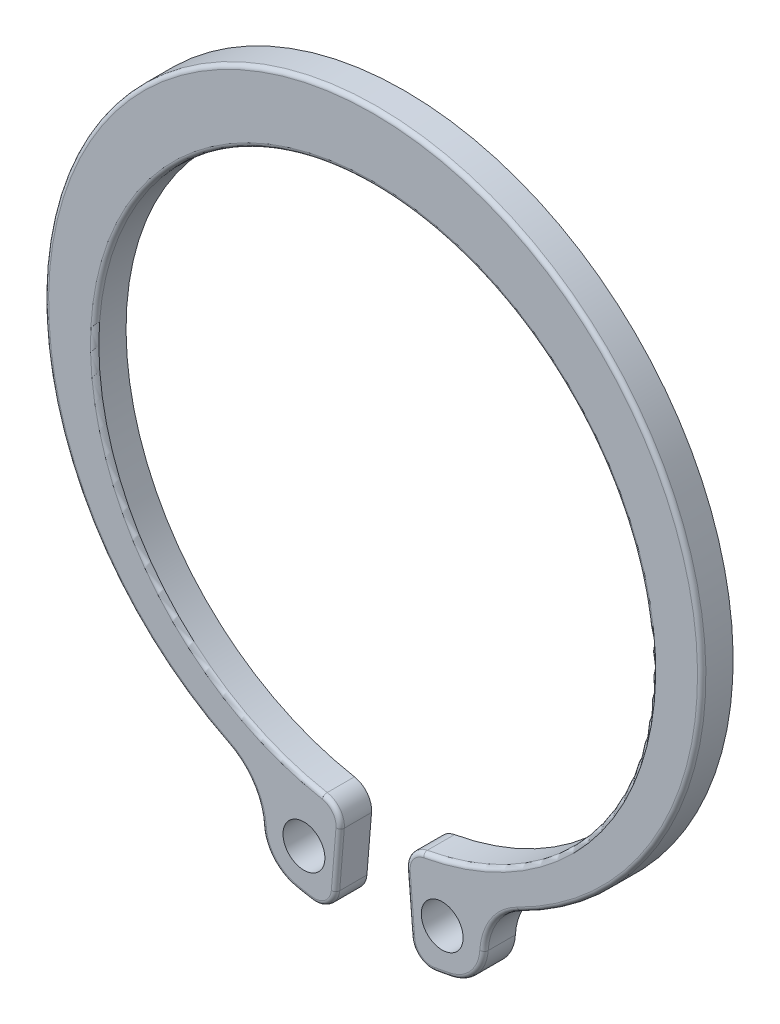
ISO-10303-21;
HEADER;
FILE_DESCRIPTION(('STEP AP214'),'2;1');
FILE_NAME('part.step','',(''),(''),'','','');
FILE_SCHEMA(('AUTOMOTIVE_DESIGN { 1 0 10303 214 1 1 1 1 }'));
ENDSEC;
DATA;
#1=APPLICATION_CONTEXT('core data for automotive mechanical design processes');
#2=APPLICATION_PROTOCOL_DEFINITION('international standard','automotive_design',2000,#1);
#3=PRODUCT_CONTEXT('',#1,'mechanical');
#4=PRODUCT('Part','Part','',(#3));
#5=PRODUCT_RELATED_PRODUCT_CATEGORY('part','',(#4));
#6=PRODUCT_DEFINITION_FORMATION('','',#4);
#7=PRODUCT_DEFINITION_CONTEXT('part definition',#1,'design');
#8=PRODUCT_DEFINITION('design','',#6,#7);
#9=PRODUCT_DEFINITION_SHAPE('','',#8);
#10=(LENGTH_UNIT() NAMED_UNIT(*) SI_UNIT(.MILLI.,.METRE.));
#11=(NAMED_UNIT(*) PLANE_ANGLE_UNIT() SI_UNIT($,.RADIAN.));
#12=(NAMED_UNIT(*) SI_UNIT($,.STERADIAN.) SOLID_ANGLE_UNIT());
#13=UNCERTAINTY_MEASURE_WITH_UNIT(LENGTH_MEASURE(1.E-05),#10,'distance_accuracy_value','');
#14=(GEOMETRIC_REPRESENTATION_CONTEXT(3) GLOBAL_UNCERTAINTY_ASSIGNED_CONTEXT((#13)) GLOBAL_UNIT_ASSIGNED_CONTEXT((#10,
#11,#12)) REPRESENTATION_CONTEXT('',''));
#15=CARTESIAN_POINT('',(0.,0.,0.));
#16=DIRECTION('',(0.,0.,1.));
#17=DIRECTION('',(1.,0.,0.));
#18=AXIS2_PLACEMENT_3D('',#15,#16,#17);
#19=CARTESIAN_POINT('',(0.,0.,1.5));
#20=DIRECTION('',(0.,0.,1.));
#21=DIRECTION('',(1.,0.,0.));
#22=AXIS2_PLACEMENT_3D('',#19,#20,#21);
#23=PLANE('',#22);
#24=DIRECTION('',(0.0817691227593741,0.996651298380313,0.));
#25=VECTOR('',#24,1.);
#26=CARTESIAN_POINT('',(-1.77235929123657,-14.1326375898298,1.5));
#27=LINE('',#26,#25);
#28=CARTESIAN_POINT('',(-1.99390940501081,-16.8330237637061,1.5));
#29=VERTEX_POINT('',#28);
#30=CARTESIAN_POINT('',(-1.77235929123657,-14.1326375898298,1.5));
#31=VERTEX_POINT('',#30);
#32=EDGE_CURVE('E279',#29,#31,#27,.T.);
#33=ORIENTED_EDGE('',*,*,#32,.T.);
#34=CARTESIAN_POINT('',(-2.56968032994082,-14.0672222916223,1.5));
#35=DIRECTION('',(0.,0.,1.));
#36=DIRECTION('',(1.,0.,0.));
#37=AXIS2_PLACEMENT_3D('',#34,#35,#36);
#38=CIRCLE('',#37,0.8);
#39=CARTESIAN_POINT('',(-2.42592198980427,-13.2802448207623,1.5));
#40=VERTEX_POINT('',#39);
#41=EDGE_CURVE('E281',#31,#40,#38,.T.);
#42=ORIENTED_EDGE('',*,*,#41,.T.);
#43=CARTESIAN_POINT('',(0.,0.,1.5));
#44=DIRECTION('',(0.,0.,1.));
#45=DIRECTION('',(1.,0.,0.));
#46=AXIS2_PLACEMENT_3D('',#43,#44,#45);
#47=CIRCLE('',#46,13.5);
#48=CARTESIAN_POINT('',(2.42592198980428,-13.2802448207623,1.5));
#49=VERTEX_POINT('',#48);
#50=EDGE_CURVE('E255',#40,#49,#47,.F.);
#51=ORIENTED_EDGE('',*,*,#50,.T.);
#52=CARTESIAN_POINT('',(2.56968032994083,-14.0672222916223,1.5));
#53=DIRECTION('',(0.,0.,1.));
#54=DIRECTION('',(1.,0.,0.));
#55=AXIS2_PLACEMENT_3D('',#52,#53,#54);
#56=CIRCLE('',#55,0.8);
#57=CARTESIAN_POINT('',(1.77235929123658,-14.1326375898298,1.5));
#58=VERTEX_POINT('',#57);
#59=EDGE_CURVE('E257',#49,#58,#56,.T.);
#60=ORIENTED_EDGE('',*,*,#59,.T.);
#61=DIRECTION('',(0.0817691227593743,-0.996651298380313,0.));
#62=VECTOR('',#61,1.);
#63=CARTESIAN_POINT('',(1.99390940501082,-16.8330237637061,1.5));
#64=LINE('',#63,#62);
#65=CARTESIAN_POINT('',(1.99390940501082,-16.8330237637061,1.5));
#66=VERTEX_POINT('',#65);
#67=EDGE_CURVE('E259',#58,#66,#64,.T.);
#68=ORIENTED_EDGE('',*,*,#67,.T.);
#69=CARTESIAN_POINT('',(2.79123044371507,-16.7676084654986,1.5));
#70=DIRECTION('',(0.,0.,1.));
#71=DIRECTION('',(1.,0.,0.));
#72=AXIS2_PLACEMENT_3D('',#69,#70,#71);
#73=CIRCLE('',#72,0.8);
#74=CARTESIAN_POINT('',(2.92259526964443,-17.5567493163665,1.5));
#75=VERTEX_POINT('',#74);
#76=EDGE_CURVE('E261',#66,#75,#73,.T.);
#77=ORIENTED_EDGE('',*,*,#76,.T.);
#78=CARTESIAN_POINT('',(0.,0.,1.5));
#79=DIRECTION('',(0.,0.,1.));
#80=DIRECTION('',(1.,0.,0.));
#81=AXIS2_PLACEMENT_3D('',#78,#79,#80);
#82=CIRCLE('',#81,17.7983428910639);
#83=CARTESIAN_POINT('',(3.67337277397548,-17.4151469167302,1.5));
#84=VERTEX_POINT('',#83);
#85=EDGE_CURVE('E263',#75,#84,#82,.T.);
#86=ORIENTED_EDGE('',*,*,#85,.T.);
#87=CARTESIAN_POINT('',(3.30187352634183,-15.6539006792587,1.5));
#88=DIRECTION('',(0.,0.,1.));
#89=DIRECTION('',(1.,0.,0.));
#90=AXIS2_PLACEMENT_3D('',#87,#88,#89);
#91=CIRCLE('',#90,1.8);
#92=CARTESIAN_POINT('',(5.09847895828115,-15.7643946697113,1.5));
#93=VERTEX_POINT('',#92);
#94=EDGE_CURVE('E265',#84,#93,#91,.T.);
#95=ORIENTED_EDGE('',*,*,#94,.T.);
#96=CARTESIAN_POINT('',(8.29244417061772,-15.9608284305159,1.5));
#97=DIRECTION('',(0.,0.,1.));
#98=DIRECTION('',(1.,0.,0.));
#99=AXIS2_PLACEMENT_3D('',#96,#97,#98);
#100=CIRCLE('',#99,3.2);
#101=CARTESIAN_POINT('',(6.87341629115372,-13.0926652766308,1.5));
#102=VERTEX_POINT('',#101);
#103=EDGE_CURVE('E267',#93,#102,#100,.F.);
#104=ORIENTED_EDGE('',*,*,#103,.T.);
#105=CARTESIAN_POINT('',(0.,0.8,1.5));
#106=DIRECTION('',(0.,0.,1.));
#107=DIRECTION('',(1.,0.,0.));
#108=AXIS2_PLACEMENT_3D('',#105,#106,#107);
#109=CIRCLE('',#108,15.5);
#110=CARTESIAN_POINT('',(-6.87341629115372,-13.0926652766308,1.5));
#111=VERTEX_POINT('',#110);
#112=EDGE_CURVE('E269',#102,#111,#109,.T.);
#113=ORIENTED_EDGE('',*,*,#112,.T.);
#114=CARTESIAN_POINT('',(-8.29244417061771,-15.9608284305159,1.5));
#115=DIRECTION('',(0.,0.,1.));
#116=DIRECTION('',(1.,0.,0.));
#117=AXIS2_PLACEMENT_3D('',#114,#115,#116);
#118=CIRCLE('',#117,3.2);
#119=CARTESIAN_POINT('',(-5.09847895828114,-15.7643946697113,1.5));
#120=VERTEX_POINT('',#119);
#121=EDGE_CURVE('E271',#111,#120,#118,.F.);
#122=ORIENTED_EDGE('',*,*,#121,.T.);
#123=CARTESIAN_POINT('',(-3.30187352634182,-15.6539006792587,1.5));
#124=DIRECTION('',(0.,0.,1.));
#125=DIRECTION('',(1.,0.,0.));
#126=AXIS2_PLACEMENT_3D('',#123,#124,#125);
#127=CIRCLE('',#126,1.8);
#128=CARTESIAN_POINT('',(-3.67337277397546,-17.4151469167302,1.5));
#129=VERTEX_POINT('',#128);
#130=EDGE_CURVE('E273',#120,#129,#127,.T.);
#131=ORIENTED_EDGE('',*,*,#130,.T.);
#132=CARTESIAN_POINT('',(0.,0.,1.5));
#133=DIRECTION('',(0.,0.,1.));
#134=DIRECTION('',(1.,0.,0.));
#135=AXIS2_PLACEMENT_3D('',#132,#133,#134);
#136=CIRCLE('',#135,17.7983428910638);
#137=CARTESIAN_POINT('',(-2.92259526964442,-17.5567493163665,1.5));
#138=VERTEX_POINT('',#137);
#139=EDGE_CURVE('E275',#129,#138,#136,.T.);
#140=ORIENTED_EDGE('',*,*,#139,.T.);
#141=CARTESIAN_POINT('',(-2.79123044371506,-16.7676084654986,1.5));
#142=DIRECTION('',(0.,0.,1.));
#143=DIRECTION('',(1.,0.,0.));
#144=AXIS2_PLACEMENT_3D('',#141,#142,#143);
#145=CIRCLE('',#144,0.8);
#146=EDGE_CURVE('E277',#138,#29,#145,.T.);
#147=ORIENTED_EDGE('',*,*,#146,.T.);
#148=EDGE_LOOP('',(#33,#42,#51,#60,#68,#77,#86,#95,#104,#113,#122,#131,#140,#147));
#149=FACE_BOUND('',#148,.T.);
#150=CARTESIAN_POINT('',(-3.30187352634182,-15.6539006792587,1.5));
#151=DIRECTION('',(0.,0.,1.));
#152=DIRECTION('',(-1.,0.,0.));
#153=AXIS2_PLACEMENT_3D('',#150,#151,#152);
#154=CIRCLE('',#153,1.);
#155=CARTESIAN_POINT('',(-4.30187352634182,-15.6539006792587,1.5));
#156=VERTEX_POINT('',#155);
#157=EDGE_CURVE('E414',#156,#156,#154,.T.);
#158=ORIENTED_EDGE('',*,*,#157,.F.);
#159=EDGE_LOOP('',(#158));
#160=FACE_BOUND('',#159,.T.);
#161=CARTESIAN_POINT('',(3.30187352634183,-15.6539006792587,1.5));
#162=DIRECTION('',(0.,0.,1.));
#163=DIRECTION('',(1.,0.,0.));
#164=AXIS2_PLACEMENT_3D('',#161,#162,#163);
#165=CIRCLE('',#164,1.);
#166=CARTESIAN_POINT('',(4.30187352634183,-15.6539006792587,1.5));
#167=VERTEX_POINT('',#166);
#168=EDGE_CURVE('E408',#167,#167,#165,.T.);
#169=ORIENTED_EDGE('',*,*,#168,.F.);
#170=EDGE_LOOP('',(#169));
#171=FACE_BOUND('',#170,.T.);
#172=ADVANCED_FACE('F32',(#149,#160,#171),#23,.T.);
#173=CARTESIAN_POINT('',(0.,0.,0.));
#174=DIRECTION('',(0.,0.,1.));
#175=DIRECTION('',(1.,0.,0.));
#176=AXIS2_PLACEMENT_3D('',#173,#174,#175);
#177=PLANE('',#176);
#178=CARTESIAN_POINT('',(-3.30187352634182,-15.6539006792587,0.));
#179=DIRECTION('',(0.,0.,1.));
#180=DIRECTION('',(-1.,0.,0.));
#181=AXIS2_PLACEMENT_3D('',#178,#179,#180);
#182=CIRCLE('',#181,1.);
#183=CARTESIAN_POINT('',(-4.30187352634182,-15.6539006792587,0.));
#184=VERTEX_POINT('',#183);
#185=EDGE_CURVE('E411',#184,#184,#182,.T.);
#186=ORIENTED_EDGE('',*,*,#185,.T.);
#187=EDGE_LOOP('',(#186));
#188=FACE_BOUND('',#187,.T.);
#189=CARTESIAN_POINT('',(0.,0.,0.));
#190=DIRECTION('',(0.,0.,1.));
#191=DIRECTION('',(1.,0.,0.));
#192=AXIS2_PLACEMENT_3D('',#189,#190,#191);
#193=CIRCLE('',#192,17.9983428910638);
#194=CARTESIAN_POINT('',(2.95543647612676,-17.7540345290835,0.));
#195=VERTEX_POINT('',#194);
#196=CARTESIAN_POINT('',(3.71465046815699,-17.610840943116,0.));
#197=VERTEX_POINT('',#196);
#198=EDGE_CURVE('E190',#195,#197,#193,.T.);
#199=ORIENTED_EDGE('',*,*,#198,.F.);
#200=CARTESIAN_POINT('',(2.79123044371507,-16.7676084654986,0.));
#201=DIRECTION('',(0.,0.,1.));
#202=DIRECTION('',(1.,0.,0.));
#203=AXIS2_PLACEMENT_3D('',#200,#201,#202);
#204=CIRCLE('',#203,1.);
#205=CARTESIAN_POINT('',(1.79457914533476,-16.8493775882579,0.));
#206=VERTEX_POINT('',#205);
#207=EDGE_CURVE('E237',#195,#206,#204,.F.);
#208=ORIENTED_EDGE('',*,*,#207,.T.);
#209=DIRECTION('',(0.0817691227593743,-0.996651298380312,0.));
#210=VECTOR('',#209,1.);
#211=CARTESIAN_POINT('',(1.49644554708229,-13.2155457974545,0.));
#212=LINE('',#211,#210);
#213=CARTESIAN_POINT('',(1.57302903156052,-14.1489914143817,0.));
#214=VERTEX_POINT('',#213);
#215=EDGE_CURVE('E195',#214,#206,#212,.T.);
#216=ORIENTED_EDGE('',*,*,#215,.F.);
#217=CARTESIAN_POINT('',(2.56968032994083,-14.0672222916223,0.));
#218=DIRECTION('',(0.,0.,1.));
#219=DIRECTION('',(1.,0.,0.));
#220=AXIS2_PLACEMENT_3D('',#217,#218,#219);
#221=CIRCLE('',#220,1.);
#222=CARTESIAN_POINT('',(2.38998240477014,-13.0835004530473,0.));
#223=VERTEX_POINT('',#222);
#224=EDGE_CURVE('E233',#214,#223,#221,.F.);
#225=ORIENTED_EDGE('',*,*,#224,.T.);
#226=CARTESIAN_POINT('',(0.,0.,0.));
#227=DIRECTION('',(0.,0.,-1.));
#228=DIRECTION('',(1.,0.,0.));
#229=AXIS2_PLACEMENT_3D('',#226,#227,#228);
#230=CIRCLE('',#229,13.3);
#231=CARTESIAN_POINT('',(-2.38998240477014,-13.0835004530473,0.));
#232=VERTEX_POINT('',#231);
#233=EDGE_CURVE('E417',#232,#223,#230,.T.);
#234=ORIENTED_EDGE('',*,*,#233,.F.);
#235=CARTESIAN_POINT('',(-2.56968032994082,-14.0672222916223,0.));
#236=DIRECTION('',(0.,0.,1.));
#237=DIRECTION('',(1.,0.,0.));
#238=AXIS2_PLACEMENT_3D('',#235,#236,#237);
#239=CIRCLE('',#238,1.);
#240=CARTESIAN_POINT('',(-1.57302903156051,-14.1489914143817,0.));
#241=VERTEX_POINT('',#240);
#242=EDGE_CURVE('E231',#232,#241,#239,.F.);
#243=ORIENTED_EDGE('',*,*,#242,.T.);
#244=DIRECTION('',(0.0817691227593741,0.996651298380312,0.));
#245=VECTOR('',#244,1.);
#246=CARTESIAN_POINT('',(-1.49644554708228,-13.2155457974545,0.));
#247=LINE('',#246,#245);
#248=CARTESIAN_POINT('',(-1.79457914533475,-16.8493775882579,0.));
#249=VERTEX_POINT('',#248);
#250=EDGE_CURVE('E218',#249,#241,#247,.T.);
#251=ORIENTED_EDGE('',*,*,#250,.F.);
#252=CARTESIAN_POINT('',(-2.79123044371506,-16.7676084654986,0.));
#253=DIRECTION('',(0.,0.,1.));
#254=DIRECTION('',(1.,0.,0.));
#255=AXIS2_PLACEMENT_3D('',#252,#253,#254);
#256=CIRCLE('',#255,1.);
#257=CARTESIAN_POINT('',(-2.95543647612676,-17.7540345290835,0.));
#258=VERTEX_POINT('',#257);
#259=EDGE_CURVE('E235',#249,#258,#256,.F.);
#260=ORIENTED_EDGE('',*,*,#259,.T.);
#261=CARTESIAN_POINT('',(0.,0.,0.));
#262=DIRECTION('',(0.,0.,1.));
#263=DIRECTION('',(-1.,0.,0.));
#264=AXIS2_PLACEMENT_3D('',#261,#262,#263);
#265=CIRCLE('',#264,17.9983428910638);
#266=CARTESIAN_POINT('',(-3.71465046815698,-17.610840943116,0.));
#267=VERTEX_POINT('',#266);
#268=EDGE_CURVE('E215',#267,#258,#265,.T.);
#269=ORIENTED_EDGE('',*,*,#268,.F.);
#270=CARTESIAN_POINT('',(-3.30187352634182,-15.6539006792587,0.));
#271=DIRECTION('',(0.,0.,1.));
#272=DIRECTION('',(-1.,0.,0.));
#273=AXIS2_PLACEMENT_3D('',#270,#271,#272);
#274=CIRCLE('',#273,2.);
#275=CARTESIAN_POINT('',(-5.29810178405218,-15.7766717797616,0.));
#276=VERTEX_POINT('',#275);
#277=EDGE_CURVE('E212',#276,#267,#274,.T.);
#278=ORIENTED_EDGE('',*,*,#277,.F.);
#279=CARTESIAN_POINT('',(-8.29244417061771,-15.9608284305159,0.));
#280=DIRECTION('',(0.,0.,-1.));
#281=DIRECTION('',(-1.,0.,0.));
#282=AXIS2_PLACEMENT_3D('',#279,#280,#281);
#283=CIRCLE('',#282,3.);
#284=CARTESIAN_POINT('',(-6.96210553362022,-13.2719254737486,0.));
#285=VERTEX_POINT('',#284);
#286=EDGE_CURVE('E209',#285,#276,#283,.T.);
#287=ORIENTED_EDGE('',*,*,#286,.F.);
#288=CARTESIAN_POINT('',(0.,0.8,0.));
#289=DIRECTION('',(0.,0.,1.));
#290=DIRECTION('',(1.,0.,0.));
#291=AXIS2_PLACEMENT_3D('',#288,#289,#290);
#292=CIRCLE('',#291,15.7);
#293=CARTESIAN_POINT('',(6.96210553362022,-13.2719254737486,0.));
#294=VERTEX_POINT('',#293);
#295=EDGE_CURVE('E203',#294,#285,#292,.T.);
#296=ORIENTED_EDGE('',*,*,#295,.F.);
#297=CARTESIAN_POINT('',(8.29244417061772,-15.9608284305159,0.));
#298=DIRECTION('',(0.,0.,-1.));
#299=DIRECTION('',(1.,0.,0.));
#300=AXIS2_PLACEMENT_3D('',#297,#298,#299);
#301=CIRCLE('',#300,3.);
#302=CARTESIAN_POINT('',(5.29810178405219,-15.7766717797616,0.));
#303=VERTEX_POINT('',#302);
#304=EDGE_CURVE('E201',#303,#294,#301,.T.);
#305=ORIENTED_EDGE('',*,*,#304,.F.);
#306=CARTESIAN_POINT('',(3.30187352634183,-15.6539006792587,0.));
#307=DIRECTION('',(0.,0.,1.));
#308=DIRECTION('',(1.,0.,0.));
#309=AXIS2_PLACEMENT_3D('',#306,#307,#308);
#310=CIRCLE('',#309,2.);
#311=EDGE_CURVE('E180',#197,#303,#310,.T.);
#312=ORIENTED_EDGE('',*,*,#311,.F.);
#313=EDGE_LOOP('',(#199,#208,#216,#225,#234,#243,#251,#260,#269,#278,#287,#296,#305,#312));
#314=FACE_BOUND('',#313,.T.);
#315=CARTESIAN_POINT('',(3.30187352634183,-15.6539006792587,0.));
#316=DIRECTION('',(0.,0.,1.));
#317=DIRECTION('',(1.,0.,0.));
#318=AXIS2_PLACEMENT_3D('',#315,#316,#317);
#319=CIRCLE('',#318,1.);
#320=CARTESIAN_POINT('',(4.30187352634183,-15.6539006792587,0.));
#321=VERTEX_POINT('',#320);
#322=EDGE_CURVE('E405',#321,#321,#319,.T.);
#323=ORIENTED_EDGE('',*,*,#322,.T.);
#324=EDGE_LOOP('',(#323));
#325=FACE_BOUND('',#324,.T.);
#326=ADVANCED_FACE('F197',(#188,#314,#325),#177,.F.);
#327=CARTESIAN_POINT('',(0.,0.,1.5));
#328=DIRECTION('',(0.,0.,-1.));
#329=DIRECTION('',(-1.,0.,0.));
#330=AXIS2_PLACEMENT_3D('',#327,#328,#329);
#331=CYLINDRICAL_SURFACE('',#330,13.3);
#332=DIRECTION('',(0.,0.,-1.));
#333=VECTOR('',#332,1.);
#334=CARTESIAN_POINT('',(2.38998240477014,-13.0835004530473,1.5));
#335=LINE('',#334,#333);
#336=CARTESIAN_POINT('',(2.38998240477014,-13.0835004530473,1.3));
#337=VERTEX_POINT('',#336);
#338=EDGE_CURVE('E253',#223,#337,#335,.F.);
#339=ORIENTED_EDGE('',*,*,#338,.T.);
#340=CARTESIAN_POINT('',(0.,0.,1.3));
#341=DIRECTION('',(0.,0.,1.));
#342=DIRECTION('',(1.,0.,0.));
#343=AXIS2_PLACEMENT_3D('',#340,#341,#342);
#344=CIRCLE('',#343,13.3);
#345=CARTESIAN_POINT('',(-2.38998240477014,-13.0835004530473,1.3));
#346=VERTEX_POINT('',#345);
#347=EDGE_CURVE('E11',#337,#346,#344,.T.);
#348=ORIENTED_EDGE('',*,*,#347,.T.);
#349=DIRECTION('',(0.,0.,-1.));
#350=VECTOR('',#349,1.);
#351=CARTESIAN_POINT('',(-2.38998240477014,-13.0835004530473,1.5));
#352=LINE('',#351,#350);
#353=EDGE_CURVE('E251',#346,#232,#352,.T.);
#354=ORIENTED_EDGE('',*,*,#353,.T.);
#355=ORIENTED_EDGE('',*,*,#233,.T.);
#356=EDGE_LOOP('',(#339,#348,#354,#355));
#357=FACE_BOUND('',#356,.T.);
#358=ADVANCED_FACE('F34',(#357),#331,.F.);
#359=CARTESIAN_POINT('',(1.49644554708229,-13.2155457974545,1.5));
#360=DIRECTION('',(0.996651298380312,0.0817691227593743,0.));
#361=DIRECTION('',(-0.0817691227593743,0.996651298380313,0.));
#362=AXIS2_PLACEMENT_3D('',#359,#360,#361);
#363=PLANE('',#362);
#364=DIRECTION('',(0.,0.,-1.));
#365=VECTOR('',#364,1.);
#366=CARTESIAN_POINT('',(1.79457914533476,-16.8493775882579,1.5));
#367=LINE('',#366,#365);
#368=CARTESIAN_POINT('',(1.79457914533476,-16.8493775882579,1.3));
#369=VERTEX_POINT('',#368);
#370=EDGE_CURVE('E241',#206,#369,#367,.F.);
#371=ORIENTED_EDGE('',*,*,#370,.T.);
#372=DIRECTION('',(0.0817691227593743,-0.996651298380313,0.));
#373=VECTOR('',#372,1.);
#374=CARTESIAN_POINT('',(1.57302903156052,-14.1489914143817,1.3));
#375=LINE('',#374,#373);
#376=CARTESIAN_POINT('',(1.57302903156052,-14.1489914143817,1.3));
#377=VERTEX_POINT('',#376);
#378=EDGE_CURVE('E54',#369,#377,#375,.F.);
#379=ORIENTED_EDGE('',*,*,#378,.T.);
#380=DIRECTION('',(0.,0.,-1.));
#381=VECTOR('',#380,1.);
#382=CARTESIAN_POINT('',(1.57302903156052,-14.1489914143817,1.5));
#383=LINE('',#382,#381);
#384=EDGE_CURVE('E239',#377,#214,#383,.T.);
#385=ORIENTED_EDGE('',*,*,#384,.T.);
#386=ORIENTED_EDGE('',*,*,#215,.T.);
#387=EDGE_LOOP('',(#371,#379,#385,#386));
#388=FACE_BOUND('',#387,.T.);
#389=ADVANCED_FACE('F315',(#388),#363,.F.);
#390=CARTESIAN_POINT('',(0.,0.,1.5));
#391=DIRECTION('',(0.,0.,-1.));
#392=DIRECTION('',(-1.,0.,0.));
#393=AXIS2_PLACEMENT_3D('',#390,#391,#392);
#394=CYLINDRICAL_SURFACE('',#393,17.9983428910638);
#395=DIRECTION('',(0.,0.,-1.));
#396=VECTOR('',#395,1.);
#397=CARTESIAN_POINT('',(3.71465046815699,-17.610840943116,1.5));
#398=LINE('',#397,#396);
#399=CARTESIAN_POINT('',(3.71465046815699,-17.610840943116,1.3));
#400=VERTEX_POINT('',#399);
#401=EDGE_CURVE('E175',#400,#197,#398,.T.);
#402=ORIENTED_EDGE('',*,*,#401,.F.);
#403=CARTESIAN_POINT('',(0.,0.,1.3));
#404=DIRECTION('',(0.,0.,1.));
#405=DIRECTION('',(1.,0.,0.));
#406=AXIS2_PLACEMENT_3D('',#403,#404,#405);
#407=CIRCLE('',#406,17.9983428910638);
#408=CARTESIAN_POINT('',(2.95543647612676,-17.7540345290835,1.3));
#409=VERTEX_POINT('',#408);
#410=EDGE_CURVE('E302',#400,#409,#407,.F.);
#411=ORIENTED_EDGE('',*,*,#410,.T.);
#412=DIRECTION('',(0.,0.,-1.));
#413=VECTOR('',#412,1.);
#414=CARTESIAN_POINT('',(2.95543647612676,-17.7540345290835,1.5));
#415=LINE('',#414,#413);
#416=EDGE_CURVE('E186',#409,#195,#415,.T.);
#417=ORIENTED_EDGE('',*,*,#416,.T.);
#418=ORIENTED_EDGE('',*,*,#198,.T.);
#419=EDGE_LOOP('',(#402,#411,#417,#418));
#420=FACE_BOUND('',#419,.T.);
#421=ADVANCED_FACE('F191',(#420),#394,.T.);
#422=CARTESIAN_POINT('',(3.30187352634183,-15.6539006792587,1.5));
#423=DIRECTION('',(0.,0.,-1.));
#424=DIRECTION('',(-1.,0.,0.));
#425=AXIS2_PLACEMENT_3D('',#422,#423,#424);
#426=CYLINDRICAL_SURFACE('',#425,2.);
#427=DIRECTION('',(0.,0.,-1.));
#428=VECTOR('',#427,1.);
#429=CARTESIAN_POINT('',(5.29810178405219,-15.7766717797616,1.5));
#430=LINE('',#429,#428);
#431=CARTESIAN_POINT('',(5.29810178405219,-15.7766717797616,1.3));
#432=VERTEX_POINT('',#431);
#433=EDGE_CURVE('E187',#432,#303,#430,.T.);
#434=ORIENTED_EDGE('',*,*,#433,.F.);
#435=CARTESIAN_POINT('',(3.30187352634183,-15.6539006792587,1.3));
#436=DIRECTION('',(0.,0.,1.));
#437=DIRECTION('',(1.,0.,0.));
#438=AXIS2_PLACEMENT_3D('',#435,#436,#437);
#439=CIRCLE('',#438,2.);
#440=EDGE_CURVE('E183',#432,#400,#439,.F.);
#441=ORIENTED_EDGE('',*,*,#440,.T.);
#442=ORIENTED_EDGE('',*,*,#401,.T.);
#443=ORIENTED_EDGE('',*,*,#311,.T.);
#444=EDGE_LOOP('',(#434,#441,#442,#443));
#445=FACE_BOUND('',#444,.T.);
#446=ADVANCED_FACE('F178',(#445),#426,.T.);
#447=CARTESIAN_POINT('',(8.29244417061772,-15.9608284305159,1.5));
#448=DIRECTION('',(0.,0.,-1.));
#449=DIRECTION('',(-1.,0.,0.));
#450=AXIS2_PLACEMENT_3D('',#447,#448,#449);
#451=CYLINDRICAL_SURFACE('',#450,3.);
#452=DIRECTION('',(0.,0.,-1.));
#453=VECTOR('',#452,1.);
#454=CARTESIAN_POINT('',(6.96210553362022,-13.2719254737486,1.5));
#455=LINE('',#454,#453);
#456=CARTESIAN_POINT('',(6.96210553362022,-13.2719254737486,1.3));
#457=VERTEX_POINT('',#456);
#458=EDGE_CURVE('E227',#457,#294,#455,.T.);
#459=ORIENTED_EDGE('',*,*,#458,.F.);
#460=CARTESIAN_POINT('',(8.29244417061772,-15.9608284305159,1.3));
#461=DIRECTION('',(0.,0.,1.));
#462=DIRECTION('',(1.,0.,0.));
#463=AXIS2_PLACEMENT_3D('',#460,#461,#462);
#464=CIRCLE('',#463,3.);
#465=EDGE_CURVE('E299',#457,#432,#464,.T.);
#466=ORIENTED_EDGE('',*,*,#465,.T.);
#467=ORIENTED_EDGE('',*,*,#433,.T.);
#468=ORIENTED_EDGE('',*,*,#304,.T.);
#469=EDGE_LOOP('',(#459,#466,#467,#468));
#470=FACE_BOUND('',#469,.T.);
#471=ADVANCED_FACE('F458',(#470),#451,.F.);
#472=CARTESIAN_POINT('',(0.,0.8,1.5));
#473=DIRECTION('',(0.,0.,-1.));
#474=DIRECTION('',(-1.,0.,0.));
#475=AXIS2_PLACEMENT_3D('',#472,#473,#474);
#476=CYLINDRICAL_SURFACE('',#475,15.7);
#477=DIRECTION('',(0.,0.,-1.));
#478=VECTOR('',#477,1.);
#479=CARTESIAN_POINT('',(-6.96210553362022,-13.2719254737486,1.5));
#480=LINE('',#479,#478);
#481=CARTESIAN_POINT('',(-6.96210553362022,-13.2719254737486,1.3));
#482=VERTEX_POINT('',#481);
#483=EDGE_CURVE('E225',#482,#285,#480,.T.);
#484=ORIENTED_EDGE('',*,*,#483,.F.);
#485=CARTESIAN_POINT('',(0.,0.8,1.3));
#486=DIRECTION('',(0.,0.,1.));
#487=DIRECTION('',(1.,0.,0.));
#488=AXIS2_PLACEMENT_3D('',#485,#486,#487);
#489=CIRCLE('',#488,15.7);
#490=EDGE_CURVE('E297',#482,#457,#489,.F.);
#491=ORIENTED_EDGE('',*,*,#490,.T.);
#492=ORIENTED_EDGE('',*,*,#458,.T.);
#493=ORIENTED_EDGE('',*,*,#295,.T.);
#494=EDGE_LOOP('',(#484,#491,#492,#493));
#495=FACE_BOUND('',#494,.T.);
#496=ADVANCED_FACE('F454',(#495),#476,.T.);
#497=CARTESIAN_POINT('',(-8.29244417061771,-15.9608284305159,1.5));
#498=DIRECTION('',(0.,0.,-1.));
#499=DIRECTION('',(-1.,0.,0.));
#500=AXIS2_PLACEMENT_3D('',#497,#498,#499);
#501=CYLINDRICAL_SURFACE('',#500,3.);
#502=DIRECTION('',(0.,0.,-1.));
#503=VECTOR('',#502,1.);
#504=CARTESIAN_POINT('',(-5.29810178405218,-15.7766717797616,1.5));
#505=LINE('',#504,#503);
#506=CARTESIAN_POINT('',(-5.29810178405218,-15.7766717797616,1.3));
#507=VERTEX_POINT('',#506);
#508=EDGE_CURVE('E223',#507,#276,#505,.T.);
#509=ORIENTED_EDGE('',*,*,#508,.F.);
#510=CARTESIAN_POINT('',(-8.29244417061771,-15.9608284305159,1.3));
#511=DIRECTION('',(0.,0.,1.));
#512=DIRECTION('',(1.,0.,0.));
#513=AXIS2_PLACEMENT_3D('',#510,#511,#512);
#514=CIRCLE('',#513,3.);
#515=EDGE_CURVE('E295',#507,#482,#514,.T.);
#516=ORIENTED_EDGE('',*,*,#515,.T.);
#517=ORIENTED_EDGE('',*,*,#483,.T.);
#518=ORIENTED_EDGE('',*,*,#286,.T.);
#519=EDGE_LOOP('',(#509,#516,#517,#518));
#520=FACE_BOUND('',#519,.T.);
#521=ADVANCED_FACE('F450',(#520),#501,.F.);
#522=CARTESIAN_POINT('',(-3.30187352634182,-15.6539006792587,1.5));
#523=DIRECTION('',(0.,0.,-1.));
#524=DIRECTION('',(-1.,0.,0.));
#525=AXIS2_PLACEMENT_3D('',#522,#523,#524);
#526=CYLINDRICAL_SURFACE('',#525,2.);
#527=DIRECTION('',(0.,0.,-1.));
#528=VECTOR('',#527,1.);
#529=CARTESIAN_POINT('',(-3.71465046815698,-17.610840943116,1.5));
#530=LINE('',#529,#528);
#531=CARTESIAN_POINT('',(-3.71465046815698,-17.610840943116,1.3));
#532=VERTEX_POINT('',#531);
#533=EDGE_CURVE('E221',#532,#267,#530,.T.);
#534=ORIENTED_EDGE('',*,*,#533,.F.);
#535=CARTESIAN_POINT('',(-3.30187352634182,-15.6539006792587,1.3));
#536=DIRECTION('',(0.,0.,1.));
#537=DIRECTION('',(1.,0.,0.));
#538=AXIS2_PLACEMENT_3D('',#535,#536,#537);
#539=CIRCLE('',#538,2.);
#540=EDGE_CURVE('E293',#532,#507,#539,.F.);
#541=ORIENTED_EDGE('',*,*,#540,.T.);
#542=ORIENTED_EDGE('',*,*,#508,.T.);
#543=ORIENTED_EDGE('',*,*,#277,.T.);
#544=EDGE_LOOP('',(#534,#541,#542,#543));
#545=FACE_BOUND('',#544,.T.);
#546=ADVANCED_FACE('F446',(#545),#526,.T.);
#547=CARTESIAN_POINT('',(0.,0.,1.5));
#548=DIRECTION('',(0.,0.,-1.));
#549=DIRECTION('',(-1.,0.,0.));
#550=AXIS2_PLACEMENT_3D('',#547,#548,#549);
#551=CYLINDRICAL_SURFACE('',#550,17.9983428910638);
#552=DIRECTION('',(0.,0.,-1.));
#553=VECTOR('',#552,1.);
#554=CARTESIAN_POINT('',(-2.95543647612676,-17.7540345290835,1.5));
#555=LINE('',#554,#553);
#556=CARTESIAN_POINT('',(-2.95543647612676,-17.7540345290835,1.3));
#557=VERTEX_POINT('',#556);
#558=EDGE_CURVE('E248',#258,#557,#555,.F.);
#559=ORIENTED_EDGE('',*,*,#558,.T.);
#560=CARTESIAN_POINT('',(0.,0.,1.3));
#561=DIRECTION('',(0.,0.,1.));
#562=DIRECTION('',(1.,0.,0.));
#563=AXIS2_PLACEMENT_3D('',#560,#561,#562);
#564=CIRCLE('',#563,17.9983428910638);
#565=EDGE_CURVE('E291',#557,#532,#564,.F.);
#566=ORIENTED_EDGE('',*,*,#565,.T.);
#567=ORIENTED_EDGE('',*,*,#533,.T.);
#568=ORIENTED_EDGE('',*,*,#268,.T.);
#569=EDGE_LOOP('',(#559,#566,#567,#568));
#570=FACE_BOUND('',#569,.T.);
#571=ADVANCED_FACE('F443',(#570),#551,.T.);
#572=CARTESIAN_POINT('',(-1.49644554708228,-13.2155457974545,1.5));
#573=DIRECTION('',(-0.996651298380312,0.0817691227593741,0.));
#574=DIRECTION('',(-0.0817691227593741,-0.996651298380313,0.));
#575=AXIS2_PLACEMENT_3D('',#572,#573,#574);
#576=PLANE('',#575);
#577=DIRECTION('',(0.,0.,-1.));
#578=VECTOR('',#577,1.);
#579=CARTESIAN_POINT('',(-1.57302903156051,-14.1489914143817,1.5));
#580=LINE('',#579,#578);
#581=CARTESIAN_POINT('',(-1.57302903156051,-14.1489914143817,1.3));
#582=VERTEX_POINT('',#581);
#583=EDGE_CURVE('E243',#241,#582,#580,.F.);
#584=ORIENTED_EDGE('',*,*,#583,.T.);
#585=DIRECTION('',(0.0817691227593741,0.996651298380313,0.));
#586=VECTOR('',#585,1.);
#587=CARTESIAN_POINT('',(-1.79457914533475,-16.8493775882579,1.3));
#588=LINE('',#587,#586);
#589=CARTESIAN_POINT('',(-1.79457914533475,-16.8493775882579,1.3));
#590=VERTEX_POINT('',#589);
#591=EDGE_CURVE('E287',#582,#590,#588,.F.);
#592=ORIENTED_EDGE('',*,*,#591,.T.);
#593=DIRECTION('',(0.,0.,-1.));
#594=VECTOR('',#593,1.);
#595=CARTESIAN_POINT('',(-1.79457914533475,-16.8493775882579,1.5));
#596=LINE('',#595,#594);
#597=EDGE_CURVE('E246',#590,#249,#596,.T.);
#598=ORIENTED_EDGE('',*,*,#597,.T.);
#599=ORIENTED_EDGE('',*,*,#250,.T.);
#600=EDGE_LOOP('',(#584,#592,#598,#599));
#601=FACE_BOUND('',#600,.T.);
#602=ADVANCED_FACE('F368',(#601),#576,.F.);
#603=CARTESIAN_POINT('',(-3.30187352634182,-15.6539006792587,1.5));
#604=DIRECTION('',(0.,0.,-1.));
#605=DIRECTION('',(-1.,0.,0.));
#606=AXIS2_PLACEMENT_3D('',#603,#604,#605);
#607=CYLINDRICAL_SURFACE('',#606,1.);
#608=ORIENTED_EDGE('',*,*,#157,.T.);
#609=EDGE_LOOP('',(#608));
#610=FACE_BOUND('',#609,.T.);
#611=ORIENTED_EDGE('',*,*,#185,.F.);
#612=EDGE_LOOP('',(#611));
#613=FACE_BOUND('',#612,.T.);
#614=ADVANCED_FACE('F442',(#610,#613),#607,.F.);
#615=CARTESIAN_POINT('',(3.30187352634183,-15.6539006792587,1.5));
#616=DIRECTION('',(0.,0.,-1.));
#617=DIRECTION('',(-1.,0.,0.));
#618=AXIS2_PLACEMENT_3D('',#615,#616,#617);
#619=CYLINDRICAL_SURFACE('',#618,1.);
#620=ORIENTED_EDGE('',*,*,#168,.T.);
#621=EDGE_LOOP('',(#620));
#622=FACE_BOUND('',#621,.T.);
#623=ORIENTED_EDGE('',*,*,#322,.F.);
#624=EDGE_LOOP('',(#623));
#625=FACE_BOUND('',#624,.T.);
#626=ADVANCED_FACE('F482',(#622,#625),#619,.F.);
#627=CARTESIAN_POINT('',(2.79123044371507,-16.7676084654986,1.5));
#628=DIRECTION('',(0.,0.,-1.));
#629=DIRECTION('',(-1.,0.,0.));
#630=AXIS2_PLACEMENT_3D('',#627,#628,#629);
#631=CYLINDRICAL_SURFACE('',#630,1.);
#632=ORIENTED_EDGE('',*,*,#416,.F.);
#633=CARTESIAN_POINT('',(2.79123044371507,-16.7676084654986,1.3));
#634=DIRECTION('',(0.,0.,1.));
#635=DIRECTION('',(1.,0.,0.));
#636=AXIS2_PLACEMENT_3D('',#633,#634,#635);
#637=CIRCLE('',#636,1.);
#638=EDGE_CURVE('E304',#409,#369,#637,.F.);
#639=ORIENTED_EDGE('',*,*,#638,.T.);
#640=ORIENTED_EDGE('',*,*,#370,.F.);
#641=ORIENTED_EDGE('',*,*,#207,.F.);
#642=EDGE_LOOP('',(#632,#639,#640,#641));
#643=FACE_BOUND('',#642,.T.);
#644=ADVANCED_FACE('F309',(#643),#631,.T.);
#645=CARTESIAN_POINT('',(-2.79123044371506,-16.7676084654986,1.5));
#646=DIRECTION('',(0.,0.,-1.));
#647=DIRECTION('',(-1.,0.,0.));
#648=AXIS2_PLACEMENT_3D('',#645,#646,#647);
#649=CYLINDRICAL_SURFACE('',#648,1.);
#650=ORIENTED_EDGE('',*,*,#597,.F.);
#651=CARTESIAN_POINT('',(-2.79123044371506,-16.7676084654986,1.3));
#652=DIRECTION('',(0.,0.,1.));
#653=DIRECTION('',(1.,0.,0.));
#654=AXIS2_PLACEMENT_3D('',#651,#652,#653);
#655=CIRCLE('',#654,1.);
#656=EDGE_CURVE('E289',#590,#557,#655,.F.);
#657=ORIENTED_EDGE('',*,*,#656,.T.);
#658=ORIENTED_EDGE('',*,*,#558,.F.);
#659=ORIENTED_EDGE('',*,*,#259,.F.);
#660=EDGE_LOOP('',(#650,#657,#658,#659));
#661=FACE_BOUND('',#660,.T.);
#662=ADVANCED_FACE('F372',(#661),#649,.T.);
#663=CARTESIAN_POINT('',(2.56968032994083,-14.0672222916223,1.5));
#664=DIRECTION('',(0.,0.,-1.));
#665=DIRECTION('',(-1.,0.,0.));
#666=AXIS2_PLACEMENT_3D('',#663,#664,#665);
#667=CYLINDRICAL_SURFACE('',#666,1.);
#668=ORIENTED_EDGE('',*,*,#384,.F.);
#669=CARTESIAN_POINT('',(2.56968032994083,-14.0672222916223,1.3));
#670=DIRECTION('',(0.,0.,1.));
#671=DIRECTION('',(1.,0.,0.));
#672=AXIS2_PLACEMENT_3D('',#669,#670,#671);
#673=CIRCLE('',#672,1.);
#674=EDGE_CURVE('E40',#377,#337,#673,.F.);
#675=ORIENTED_EDGE('',*,*,#674,.T.);
#676=ORIENTED_EDGE('',*,*,#338,.F.);
#677=ORIENTED_EDGE('',*,*,#224,.F.);
#678=EDGE_LOOP('',(#668,#675,#676,#677));
#679=FACE_BOUND('',#678,.T.);
#680=ADVANCED_FACE('F419',(#679),#667,.T.);
#681=CARTESIAN_POINT('',(-2.56968032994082,-14.0672222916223,1.5));
#682=DIRECTION('',(0.,0.,-1.));
#683=DIRECTION('',(-1.,0.,0.));
#684=AXIS2_PLACEMENT_3D('',#681,#682,#683);
#685=CYLINDRICAL_SURFACE('',#684,1.);
#686=ORIENTED_EDGE('',*,*,#353,.F.);
#687=CARTESIAN_POINT('',(-2.56968032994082,-14.0672222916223,1.3));
#688=DIRECTION('',(0.,0.,1.));
#689=DIRECTION('',(1.,0.,0.));
#690=AXIS2_PLACEMENT_3D('',#687,#688,#689);
#691=CIRCLE('',#690,1.);
#692=EDGE_CURVE('E284',#346,#582,#691,.F.);
#693=ORIENTED_EDGE('',*,*,#692,.T.);
#694=ORIENTED_EDGE('',*,*,#583,.F.);
#695=ORIENTED_EDGE('',*,*,#242,.F.);
#696=EDGE_LOOP('',(#686,#693,#694,#695));
#697=FACE_BOUND('',#696,.T.);
#698=ADVANCED_FACE('F352',(#697),#685,.T.);
#699=CARTESIAN_POINT('',(8.29244417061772,-15.9608284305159,1.3));
#700=DIRECTION('',(0.,0.,1.));
#701=DIRECTION('',(1.,0.,0.));
#702=AXIS2_PLACEMENT_3D('',#699,#700,#701);
#703=TOROIDAL_SURFACE('',#702,3.2,0.2);
#704=CARTESIAN_POINT('',(5.09847895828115,-15.7643946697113,1.3));
#705=DIRECTION('',(-0.0613855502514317,-0.998114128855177,0.));
#706=DIRECTION('',(0.998114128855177,-0.0613855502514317,0.));
#707=AXIS2_PLACEMENT_3D('',#704,#705,#706);
#708=CIRCLE('',#707,0.2);
#709=EDGE_CURVE('E399',#432,#93,#708,.T.);
#710=ORIENTED_EDGE('',*,*,#709,.F.);
#711=ORIENTED_EDGE('',*,*,#465,.F.);
#712=CARTESIAN_POINT('',(6.87341629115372,-13.0926652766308,1.3));
#713=DIRECTION('',(0.896300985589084,0.443446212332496,0.));
#714=DIRECTION('',(-0.443446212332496,0.896300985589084,0.));
#715=AXIS2_PLACEMENT_3D('',#712,#713,#714);
#716=CIRCLE('',#715,0.2);
#717=EDGE_CURVE('E402',#102,#457,#716,.T.);
#718=ORIENTED_EDGE('',*,*,#717,.F.);
#719=ORIENTED_EDGE('',*,*,#103,.F.);
#720=EDGE_LOOP('',(#710,#711,#718,#719));
#721=FACE_BOUND('',#720,.T.);
#722=ADVANCED_FACE('F426',(#721),#703,.T.);
#723=CARTESIAN_POINT('',(0.,0.8,1.3));
#724=DIRECTION('',(0.,0.,1.));
#725=DIRECTION('',(1.,0.,0.));
#726=AXIS2_PLACEMENT_3D('',#723,#724,#725);
#727=TOROIDAL_SURFACE('',#726,15.5,0.2);
#728=ORIENTED_EDGE('',*,*,#717,.T.);
#729=ORIENTED_EDGE('',*,*,#490,.F.);
#730=CARTESIAN_POINT('',(-6.87341629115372,-13.0926652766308,1.3));
#731=DIRECTION('',(0.896300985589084,-0.443446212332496,0.));
#732=DIRECTION('',(0.443446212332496,0.896300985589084,0.));
#733=AXIS2_PLACEMENT_3D('',#730,#731,#732);
#734=CIRCLE('',#733,0.2);
#735=EDGE_CURVE('E396',#111,#482,#734,.T.);
#736=ORIENTED_EDGE('',*,*,#735,.F.);
#737=ORIENTED_EDGE('',*,*,#112,.F.);
#738=EDGE_LOOP('',(#728,#729,#736,#737));
#739=FACE_BOUND('',#738,.T.);
#740=ADVANCED_FACE('F585',(#739),#727,.T.);
#741=CARTESIAN_POINT('',(3.30187352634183,-15.6539006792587,1.3));
#742=DIRECTION('',(0.,0.,1.));
#743=DIRECTION('',(1.,0.,0.));
#744=AXIS2_PLACEMENT_3D('',#741,#742,#743);
#745=TOROIDAL_SURFACE('',#744,1.8,0.2);
#746=ORIENTED_EDGE('',*,*,#709,.T.);
#747=ORIENTED_EDGE('',*,*,#94,.F.);
#748=CARTESIAN_POINT('',(3.67337277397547,-17.4151469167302,1.3));
#749=DIRECTION('',(-0.978470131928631,-0.206388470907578,0.));
#750=DIRECTION('',(0.206388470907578,-0.978470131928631,0.));
#751=AXIS2_PLACEMENT_3D('',#748,#749,#750);
#752=CIRCLE('',#751,0.2);
#753=EDGE_CURVE('E393',#400,#84,#752,.T.);
#754=ORIENTED_EDGE('',*,*,#753,.F.);
#755=ORIENTED_EDGE('',*,*,#440,.F.);
#756=EDGE_LOOP('',(#746,#747,#754,#755));
#757=FACE_BOUND('',#756,.T.);
#758=ADVANCED_FACE('F595',(#757),#745,.T.);
#759=CARTESIAN_POINT('',(-8.29244417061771,-15.9608284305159,1.3));
#760=DIRECTION('',(0.,0.,1.));
#761=DIRECTION('',(1.,0.,0.));
#762=AXIS2_PLACEMENT_3D('',#759,#760,#761);
#763=TOROIDAL_SURFACE('',#762,3.2,0.2);
#764=ORIENTED_EDGE('',*,*,#735,.T.);
#765=ORIENTED_EDGE('',*,*,#515,.F.);
#766=CARTESIAN_POINT('',(-5.09847895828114,-15.7643946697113,1.3));
#767=DIRECTION('',(0.0613855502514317,-0.998114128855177,0.));
#768=DIRECTION('',(0.998114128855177,0.0613855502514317,0.));
#769=AXIS2_PLACEMENT_3D('',#766,#767,#768);
#770=CIRCLE('',#769,0.2);
#771=EDGE_CURVE('E390',#120,#507,#770,.T.);
#772=ORIENTED_EDGE('',*,*,#771,.F.);
#773=ORIENTED_EDGE('',*,*,#121,.F.);
#774=EDGE_LOOP('',(#764,#765,#772,#773));
#775=FACE_BOUND('',#774,.T.);
#776=ADVANCED_FACE('F605',(#775),#763,.T.);
#777=CARTESIAN_POINT('',(0.,0.,1.3));
#778=DIRECTION('',(0.,0.,1.));
#779=DIRECTION('',(1.,0.,0.));
#780=AXIS2_PLACEMENT_3D('',#777,#778,#779);
#781=TOROIDAL_SURFACE('',#780,17.7983428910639,0.2);
#782=ORIENTED_EDGE('',*,*,#753,.T.);
#783=ORIENTED_EDGE('',*,*,#85,.F.);
#784=CARTESIAN_POINT('',(2.92259526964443,-17.5567493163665,1.3));
#785=DIRECTION('',(-0.986426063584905,-0.164206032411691,0.));
#786=DIRECTION('',(0.164206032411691,-0.986426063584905,0.));
#787=AXIS2_PLACEMENT_3D('',#784,#785,#786);
#788=CIRCLE('',#787,0.2);
#789=EDGE_CURVE('E388',#409,#75,#788,.T.);
#790=ORIENTED_EDGE('',*,*,#789,.F.);
#791=ORIENTED_EDGE('',*,*,#410,.F.);
#792=EDGE_LOOP('',(#782,#783,#790,#791));
#793=FACE_BOUND('',#792,.T.);
#794=ADVANCED_FACE('F615',(#793),#781,.T.);
#795=CARTESIAN_POINT('',(-3.30187352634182,-15.6539006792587,1.3));
#796=DIRECTION('',(0.,0.,1.));
#797=DIRECTION('',(1.,0.,0.));
#798=AXIS2_PLACEMENT_3D('',#795,#796,#797);
#799=TOROIDAL_SURFACE('',#798,1.8,0.2);
#800=ORIENTED_EDGE('',*,*,#771,.T.);
#801=ORIENTED_EDGE('',*,*,#540,.F.);
#802=CARTESIAN_POINT('',(-3.67337277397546,-17.4151469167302,1.3));
#803=DIRECTION('',(0.978470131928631,-0.206388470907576,0.));
#804=DIRECTION('',(0.206388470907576,0.978470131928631,0.));
#805=AXIS2_PLACEMENT_3D('',#802,#803,#804);
#806=CIRCLE('',#805,0.2);
#807=EDGE_CURVE('E323',#129,#532,#806,.T.);
#808=ORIENTED_EDGE('',*,*,#807,.F.);
#809=ORIENTED_EDGE('',*,*,#130,.F.);
#810=EDGE_LOOP('',(#800,#801,#808,#809));
#811=FACE_BOUND('',#810,.T.);
#812=ADVANCED_FACE('F625',(#811),#799,.T.);
#813=CARTESIAN_POINT('',(2.79123044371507,-16.7676084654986,1.3));
#814=DIRECTION('',(0.,0.,1.));
#815=DIRECTION('',(1.,0.,0.));
#816=AXIS2_PLACEMENT_3D('',#813,#814,#815);
#817=TOROIDAL_SURFACE('',#816,0.8,0.2);
#818=ORIENTED_EDGE('',*,*,#789,.T.);
#819=ORIENTED_EDGE('',*,*,#76,.F.);
#820=CARTESIAN_POINT('',(1.99390940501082,-16.8330237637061,1.3));
#821=DIRECTION('',(-0.0817691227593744,0.996651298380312,0.));
#822=DIRECTION('',(-0.996651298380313,-0.0817691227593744,0.));
#823=AXIS2_PLACEMENT_3D('',#820,#821,#822);
#824=CIRCLE('',#823,0.2);
#825=EDGE_CURVE('E319',#369,#66,#824,.T.);
#826=ORIENTED_EDGE('',*,*,#825,.F.);
#827=ORIENTED_EDGE('',*,*,#638,.F.);
#828=EDGE_LOOP('',(#818,#819,#826,#827));
#829=FACE_BOUND('',#828,.T.);
#830=ADVANCED_FACE('F320',(#829),#817,.T.);
#831=CARTESIAN_POINT('',(0.,0.,1.3));
#832=DIRECTION('',(0.,0.,1.));
#833=DIRECTION('',(1.,0.,0.));
#834=AXIS2_PLACEMENT_3D('',#831,#832,#833);
#835=TOROIDAL_SURFACE('',#834,17.7983428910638,0.2);
#836=ORIENTED_EDGE('',*,*,#807,.T.);
#837=ORIENTED_EDGE('',*,*,#565,.F.);
#838=CARTESIAN_POINT('',(-2.92259526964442,-17.5567493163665,1.3));
#839=DIRECTION('',(0.986426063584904,-0.164206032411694,0.));
#840=DIRECTION('',(0.164206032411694,0.986426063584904,0.));
#841=AXIS2_PLACEMENT_3D('',#838,#839,#840);
#842=CIRCLE('',#841,0.2);
#843=EDGE_CURVE('E324',#138,#557,#842,.T.);
#844=ORIENTED_EDGE('',*,*,#843,.F.);
#845=ORIENTED_EDGE('',*,*,#139,.F.);
#846=EDGE_LOOP('',(#836,#837,#844,#845));
#847=FACE_BOUND('',#846,.T.);
#848=ADVANCED_FACE('F644',(#847),#835,.T.);
#849=CARTESIAN_POINT('',(0.608765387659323,0.0499454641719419,1.3));
#850=DIRECTION('',(-0.0817691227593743,0.996651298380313,0.));
#851=DIRECTION('',(-0.996651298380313,-0.0817691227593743,0.));
#852=AXIS2_PLACEMENT_3D('',#849,#850,#851);
#853=CYLINDRICAL_SURFACE('',#852,0.2);
#854=ORIENTED_EDGE('',*,*,#825,.T.);
#855=ORIENTED_EDGE('',*,*,#67,.F.);
#856=CARTESIAN_POINT('',(1.77235929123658,-14.1326375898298,1.3));
#857=DIRECTION('',(-0.0817691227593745,0.996651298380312,0.));
#858=DIRECTION('',(-0.996651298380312,-0.0817691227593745,0.));
#859=AXIS2_PLACEMENT_3D('',#856,#857,#858);
#860=CIRCLE('',#859,0.2);
#861=EDGE_CURVE('E329',#377,#58,#860,.T.);
#862=ORIENTED_EDGE('',*,*,#861,.F.);
#863=ORIENTED_EDGE('',*,*,#378,.F.);
#864=EDGE_LOOP('',(#854,#855,#862,#863));
#865=FACE_BOUND('',#864,.T.);
#866=ADVANCED_FACE('F327',(#865),#853,.T.);
#867=CARTESIAN_POINT('',(-2.79123044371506,-16.7676084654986,1.3));
#868=DIRECTION('',(0.,0.,1.));
#869=DIRECTION('',(1.,0.,0.));
#870=AXIS2_PLACEMENT_3D('',#867,#868,#869);
#871=TOROIDAL_SURFACE('',#870,0.8,0.2);
#872=ORIENTED_EDGE('',*,*,#843,.T.);
#873=ORIENTED_EDGE('',*,*,#656,.F.);
#874=CARTESIAN_POINT('',(-1.99390940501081,-16.8330237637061,1.3));
#875=DIRECTION('',(0.0817691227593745,0.996651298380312,0.));
#876=DIRECTION('',(-0.996651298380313,0.0817691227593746,0.));
#877=AXIS2_PLACEMENT_3D('',#874,#875,#876);
#878=CIRCLE('',#877,0.2);
#879=EDGE_CURVE('E332',#29,#590,#878,.T.);
#880=ORIENTED_EDGE('',*,*,#879,.F.);
#881=ORIENTED_EDGE('',*,*,#146,.F.);
#882=EDGE_LOOP('',(#872,#873,#880,#881));
#883=FACE_BOUND('',#882,.T.);
#884=ADVANCED_FACE('F377',(#883),#871,.T.);
#885=CARTESIAN_POINT('',(2.56968032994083,-14.0672222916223,1.3));
#886=DIRECTION('',(0.,0.,1.));
#887=DIRECTION('',(1.,0.,0.));
#888=AXIS2_PLACEMENT_3D('',#885,#886,#887);
#889=TOROIDAL_SURFACE('',#888,0.8,0.2);
#890=ORIENTED_EDGE('',*,*,#861,.T.);
#891=ORIENTED_EDGE('',*,*,#59,.F.);
#892=CARTESIAN_POINT('',(2.42592198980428,-13.2802448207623,1.3));
#893=DIRECTION('',(0.983721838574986,0.179697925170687,0.));
#894=DIRECTION('',(-0.179697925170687,0.983721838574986,0.));
#895=AXIS2_PLACEMENT_3D('',#892,#893,#894);
#896=CIRCLE('',#895,0.2);
#897=EDGE_CURVE('E337',#337,#49,#896,.T.);
#898=ORIENTED_EDGE('',*,*,#897,.F.);
#899=ORIENTED_EDGE('',*,*,#674,.F.);
#900=EDGE_LOOP('',(#890,#891,#898,#899));
#901=FACE_BOUND('',#900,.T.);
#902=ADVANCED_FACE('F335',(#901),#889,.T.);
#903=CARTESIAN_POINT('',(-0.608765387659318,0.0499454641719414,1.3));
#904=DIRECTION('',(-0.0817691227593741,-0.996651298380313,0.));
#905=DIRECTION('',(0.996651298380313,-0.0817691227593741,0.));
#906=AXIS2_PLACEMENT_3D('',#903,#904,#905);
#907=CYLINDRICAL_SURFACE('',#906,0.2);
#908=ORIENTED_EDGE('',*,*,#879,.T.);
#909=ORIENTED_EDGE('',*,*,#591,.F.);
#910=CARTESIAN_POINT('',(-1.77235929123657,-14.1326375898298,1.3));
#911=DIRECTION('',(0.0817691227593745,0.996651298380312,0.));
#912=DIRECTION('',(-0.996651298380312,0.0817691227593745,0.));
#913=AXIS2_PLACEMENT_3D('',#910,#911,#912);
#914=CIRCLE('',#913,0.2);
#915=EDGE_CURVE('E341',#31,#582,#914,.T.);
#916=ORIENTED_EDGE('',*,*,#915,.F.);
#917=ORIENTED_EDGE('',*,*,#32,.F.);
#918=EDGE_LOOP('',(#908,#909,#916,#917));
#919=FACE_BOUND('',#918,.T.);
#920=ADVANCED_FACE('F364',(#919),#907,.T.);
#921=CARTESIAN_POINT('',(0.,0.,1.3));
#922=DIRECTION('',(0.,0.,1.));
#923=DIRECTION('',(1.,0.,0.));
#924=AXIS2_PLACEMENT_3D('',#921,#922,#923);
#925=TOROIDAL_SURFACE('',#924,13.5,0.2);
#926=ORIENTED_EDGE('',*,*,#897,.T.);
#927=ORIENTED_EDGE('',*,*,#50,.F.);
#928=CARTESIAN_POINT('',(-2.42592198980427,-13.2802448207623,1.3));
#929=DIRECTION('',(0.983721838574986,-0.179697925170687,0.));
#930=DIRECTION('',(0.179697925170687,0.983721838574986,0.));
#931=AXIS2_PLACEMENT_3D('',#928,#929,#930);
#932=CIRCLE('',#931,0.2);
#933=EDGE_CURVE('E345',#346,#40,#932,.T.);
#934=ORIENTED_EDGE('',*,*,#933,.F.);
#935=ORIENTED_EDGE('',*,*,#347,.F.);
#936=EDGE_LOOP('',(#926,#927,#934,#935));
#937=FACE_BOUND('',#936,.T.);
#938=ADVANCED_FACE('F344',(#937),#925,.T.);
#939=CARTESIAN_POINT('',(-2.56968032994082,-14.0672222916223,1.3));
#940=DIRECTION('',(0.,0.,1.));
#941=DIRECTION('',(1.,0.,0.));
#942=AXIS2_PLACEMENT_3D('',#939,#940,#941);
#943=TOROIDAL_SURFACE('',#942,0.8,0.2);
#944=ORIENTED_EDGE('',*,*,#915,.T.);
#945=ORIENTED_EDGE('',*,*,#692,.F.);
#946=ORIENTED_EDGE('',*,*,#933,.T.);
#947=ORIENTED_EDGE('',*,*,#41,.F.);
#948=EDGE_LOOP('',(#944,#945,#946,#947));
#949=FACE_BOUND('',#948,.T.);
#950=ADVANCED_FACE('F356',(#949),#943,.T.);
#951=CLOSED_SHELL('',(#172,#326,#358,#389,#421,#446,#471,#496,#521,#546,#571,#602,#614,#626,
#644,#662,#680,#698,#722,#740,#758,#776,#794,#812,#830,#848,#866,#884,#902,#920,#938,#950));
#952=MANIFOLD_SOLID_BREP('B2',#951);
#953=ADVANCED_BREP_SHAPE_REPRESENTATION('',(#18,#952),#14);
#954=SHAPE_DEFINITION_REPRESENTATION(#9,#953);
ENDSEC;
END-ISO-10303-21;
